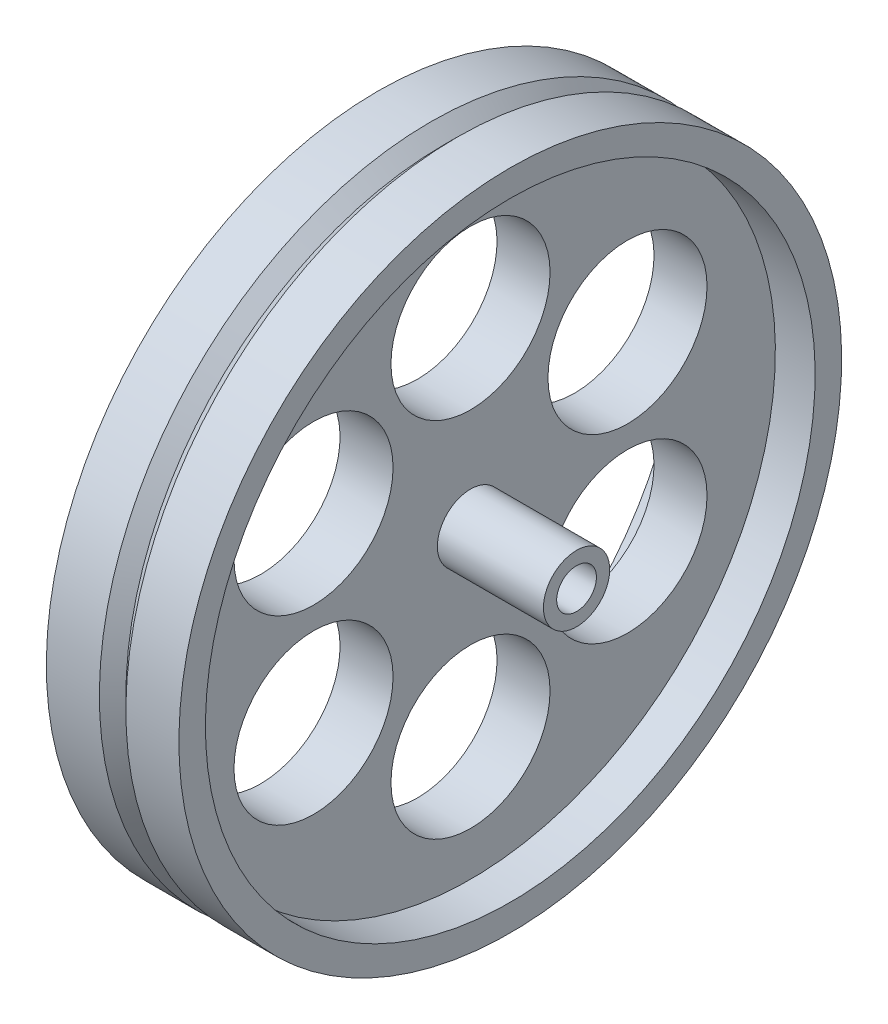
ISO-10303-21;
HEADER;
FILE_DESCRIPTION(('STEP AP214'),'2;1');
FILE_NAME('part.step','',(''),(''),'','','');
FILE_SCHEMA(('AUTOMOTIVE_DESIGN { 1 0 10303 214 1 1 1 1 }'));
ENDSEC;
DATA;
#1=APPLICATION_CONTEXT('core data for automotive mechanical design processes');
#2=APPLICATION_PROTOCOL_DEFINITION('international standard','automotive_design',2000,#1);
#3=PRODUCT_CONTEXT('',#1,'mechanical');
#4=PRODUCT('Part','Part','',(#3));
#5=PRODUCT_RELATED_PRODUCT_CATEGORY('part','',(#4));
#6=PRODUCT_DEFINITION_FORMATION('','',#4);
#7=PRODUCT_DEFINITION_CONTEXT('part definition',#1,'design');
#8=PRODUCT_DEFINITION('design','',#6,#7);
#9=PRODUCT_DEFINITION_SHAPE('','',#8);
#10=(LENGTH_UNIT() NAMED_UNIT(*) SI_UNIT(.MILLI.,.METRE.));
#11=(NAMED_UNIT(*) PLANE_ANGLE_UNIT() SI_UNIT($,.RADIAN.));
#12=(NAMED_UNIT(*) SI_UNIT($,.STERADIAN.) SOLID_ANGLE_UNIT());
#13=UNCERTAINTY_MEASURE_WITH_UNIT(LENGTH_MEASURE(1.E-05),#10,'distance_accuracy_value','');
#14=(GEOMETRIC_REPRESENTATION_CONTEXT(3) GLOBAL_UNCERTAINTY_ASSIGNED_CONTEXT((#13)) GLOBAL_UNIT_ASSIGNED_CONTEXT((#10,
#11,#12)) REPRESENTATION_CONTEXT('',''));
#15=CARTESIAN_POINT('',(0.,0.,0.));
#16=DIRECTION('',(0.,0.,1.));
#17=DIRECTION('',(1.,0.,0.));
#18=AXIS2_PLACEMENT_3D('',#15,#16,#17);
#19=CARTESIAN_POINT('',(30.,-3.,0.));
#20=DIRECTION('',(1.,0.,0.));
#21=DIRECTION('',(0.,1.,0.));
#22=AXIS2_PLACEMENT_3D('',#19,#20,#21);
#23=CYLINDRICAL_SURFACE('',#22,3.);
#24=CARTESIAN_POINT('',(30.,-3.,0.));
#25=DIRECTION('',(1.,0.,0.));
#26=DIRECTION('',(0.,1.,0.));
#27=AXIS2_PLACEMENT_3D('',#24,#25,#26);
#28=CIRCLE('',#27,3.);
#29=CARTESIAN_POINT('',(30.,0.,0.));
#30=VERTEX_POINT('',#29);
#31=EDGE_CURVE('E88',#30,#30,#28,.T.);
#32=ORIENTED_EDGE('',*,*,#31,.T.);
#33=EDGE_LOOP('',(#32));
#34=FACE_BOUND('',#33,.T.);
#35=CARTESIAN_POINT('',(0.,-3.,0.));
#36=DIRECTION('',(1.,0.,0.));
#37=DIRECTION('',(0.,1.,0.));
#38=AXIS2_PLACEMENT_3D('',#35,#36,#37);
#39=CIRCLE('',#38,3.);
#40=CARTESIAN_POINT('',(0.,0.,0.));
#41=VERTEX_POINT('',#40);
#42=EDGE_CURVE('E10',#41,#41,#39,.T.);
#43=ORIENTED_EDGE('',*,*,#42,.F.);
#44=EDGE_LOOP('',(#43));
#45=FACE_BOUND('',#44,.T.);
#46=ADVANCED_FACE('F40',(#34,#45),#23,.F.);
#47=CARTESIAN_POINT('',(0.,0.,0.));
#48=DIRECTION('',(-1.,0.,0.));
#49=DIRECTION('',(0.,-1.,0.));
#50=AXIS2_PLACEMENT_3D('',#47,#48,#49);
#51=PLANE('',#50);
#52=ORIENTED_EDGE('',*,*,#42,.T.);
#53=EDGE_LOOP('',(#52));
#54=FACE_BOUND('',#53,.T.);
#55=CARTESIAN_POINT('',(0.,-3.,0.));
#56=DIRECTION('',(1.,0.,0.));
#57=DIRECTION('',(0.,1.,0.));
#58=AXIS2_PLACEMENT_3D('',#55,#56,#57);
#59=CIRCLE('',#58,5.);
#60=CARTESIAN_POINT('',(0.,2.,0.));
#61=VERTEX_POINT('',#60);
#62=EDGE_CURVE('E47',#61,#61,#59,.T.);
#63=ORIENTED_EDGE('',*,*,#62,.F.);
#64=EDGE_LOOP('',(#63));
#65=FACE_BOUND('',#64,.T.);
#66=ADVANCED_FACE('F131',(#54,#65),#51,.T.);
#67=CARTESIAN_POINT('',(30.,-3.,0.));
#68=DIRECTION('',(1.,0.,0.));
#69=DIRECTION('',(0.,1.,0.));
#70=AXIS2_PLACEMENT_3D('',#67,#68,#69);
#71=CYLINDRICAL_SURFACE('',#70,5.);
#72=ORIENTED_EDGE('',*,*,#62,.T.);
#73=EDGE_LOOP('',(#72));
#74=FACE_BOUND('',#73,.T.);
#75=CARTESIAN_POINT('',(6.00000000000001,-3.,0.));
#76=DIRECTION('',(1.,0.,0.));
#77=DIRECTION('',(0.,1.,0.));
#78=AXIS2_PLACEMENT_3D('',#75,#76,#77);
#79=CIRCLE('',#78,5.);
#80=CARTESIAN_POINT('',(6.,2.,0.));
#81=VERTEX_POINT('',#80);
#82=EDGE_CURVE('E52',#81,#81,#79,.T.);
#83=ORIENTED_EDGE('',*,*,#82,.F.);
#84=EDGE_LOOP('',(#83));
#85=FACE_BOUND('',#84,.T.);
#86=ADVANCED_FACE('F129',(#74,#85),#71,.T.);
#87=CARTESIAN_POINT('',(6.,43.,0.));
#88=DIRECTION('',(-1.,0.,0.));
#89=DIRECTION('',(0.,-1.,0.));
#90=AXIS2_PLACEMENT_3D('',#87,#88,#89);
#91=PLANE('',#90);
#92=CARTESIAN_POINT('',(6.00000000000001,-30.3517327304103,7.07769122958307E-13));
#93=DIRECTION('',(-1.,0.,0.));
#94=DIRECTION('',(0.,-1.,0.));
#95=AXIS2_PLACEMENT_3D('',#92,#93,#94);
#96=CIRCLE('',#95,12.);
#97=CARTESIAN_POINT('',(6.00000000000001,-42.3517327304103,7.07769122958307E-13));
#98=VERTEX_POINT('',#97);
#99=EDGE_CURVE('E85',#98,#98,#96,.T.);
#100=ORIENTED_EDGE('',*,*,#99,.F.);
#101=EDGE_LOOP('',(#100));
#102=FACE_BOUND('',#101,.T.);
#103=CARTESIAN_POINT('',(6.00000000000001,-16.6758663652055,-23.6872953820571));
#104=DIRECTION('',(-1.,0.,0.));
#105=DIRECTION('',(0.,-1.,0.));
#106=AXIS2_PLACEMENT_3D('',#103,#104,#105);
#107=CIRCLE('',#106,12.);
#108=CARTESIAN_POINT('',(6.00000000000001,-28.6758663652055,-23.6872953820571));
#109=VERTEX_POINT('',#108);
#110=EDGE_CURVE('E73',#109,#109,#107,.T.);
#111=ORIENTED_EDGE('',*,*,#110,.F.);
#112=EDGE_LOOP('',(#111));
#113=FACE_BOUND('',#112,.T.);
#114=CARTESIAN_POINT('',(6.00000000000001,-16.6758663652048,23.6872953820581));
#115=DIRECTION('',(-1.,0.,0.));
#116=DIRECTION('',(0.,-1.,0.));
#117=AXIS2_PLACEMENT_3D('',#114,#115,#116);
#118=CIRCLE('',#117,12.);
#119=CARTESIAN_POINT('',(6.00000000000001,-28.6758663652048,23.6872953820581));
#120=VERTEX_POINT('',#119);
#121=EDGE_CURVE('E70',#120,#120,#118,.T.);
#122=ORIENTED_EDGE('',*,*,#121,.F.);
#123=EDGE_LOOP('',(#122));
#124=FACE_BOUND('',#123,.T.);
#125=CARTESIAN_POINT('',(6.,24.3517327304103,0.));
#126=DIRECTION('',(-1.,0.,0.));
#127=DIRECTION('',(0.,-1.,0.));
#128=AXIS2_PLACEMENT_3D('',#125,#126,#127);
#129=CIRCLE('',#128,12.);
#130=CARTESIAN_POINT('',(6.,12.3517327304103,0.));
#131=VERTEX_POINT('',#130);
#132=EDGE_CURVE('E67',#131,#131,#129,.T.);
#133=ORIENTED_EDGE('',*,*,#132,.F.);
#134=EDGE_LOOP('',(#133));
#135=FACE_BOUND('',#134,.T.);
#136=CARTESIAN_POINT('',(6.00000000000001,10.6758663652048,-23.6872953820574));
#137=DIRECTION('',(-1.,0.,0.));
#138=DIRECTION('',(0.,-1.,0.));
#139=AXIS2_PLACEMENT_3D('',#136,#137,#138);
#140=CIRCLE('',#139,12.);
#141=CARTESIAN_POINT('',(6.00000000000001,-1.32413363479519,-23.6872953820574));
#142=VERTEX_POINT('',#141);
#143=EDGE_CURVE('E63',#142,#142,#140,.T.);
#144=ORIENTED_EDGE('',*,*,#143,.F.);
#145=EDGE_LOOP('',(#144));
#146=FACE_BOUND('',#145,.T.);
#147=CARTESIAN_POINT('',(6.00000000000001,10.6758663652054,23.6872953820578));
#148=DIRECTION('',(-1.,0.,0.));
#149=DIRECTION('',(0.,-1.,0.));
#150=AXIS2_PLACEMENT_3D('',#147,#148,#149);
#151=CIRCLE('',#150,12.);
#152=CARTESIAN_POINT('',(6.00000000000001,-1.32413363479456,23.6872953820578));
#153=VERTEX_POINT('',#152);
#154=EDGE_CURVE('E59',#153,#153,#151,.T.);
#155=ORIENTED_EDGE('',*,*,#154,.F.);
#156=EDGE_LOOP('',(#155));
#157=FACE_BOUND('',#156,.T.);
#158=ORIENTED_EDGE('',*,*,#82,.T.);
#159=EDGE_LOOP('',(#158));
#160=FACE_BOUND('',#159,.T.);
#161=CARTESIAN_POINT('',(6.00000000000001,-3.,0.));
#162=DIRECTION('',(1.,0.,0.));
#163=DIRECTION('',(0.,1.,0.));
#164=AXIS2_PLACEMENT_3D('',#161,#162,#163);
#165=CIRCLE('',#164,46.);
#166=CARTESIAN_POINT('',(6.,43.,0.));
#167=VERTEX_POINT('',#166);
#168=EDGE_CURVE('E121',#167,#167,#165,.T.);
#169=ORIENTED_EDGE('',*,*,#168,.F.);
#170=EDGE_LOOP('',(#169));
#171=FACE_BOUND('',#170,.T.);
#172=ADVANCED_FACE('F126',(#102,#113,#124,#135,#146,#157,#160,#171),#91,.T.);
#173=CARTESIAN_POINT('',(30.,-3.,0.));
#174=DIRECTION('',(1.,0.,0.));
#175=DIRECTION('',(0.,1.,0.));
#176=AXIS2_PLACEMENT_3D('',#173,#174,#175);
#177=CYLINDRICAL_SURFACE('',#176,46.);
#178=ORIENTED_EDGE('',*,*,#168,.T.);
#179=EDGE_LOOP('',(#178));
#180=FACE_BOUND('',#179,.T.);
#181=CARTESIAN_POINT('',(0.,-3.,0.));
#182=DIRECTION('',(1.,0.,0.));
#183=DIRECTION('',(0.,1.,0.));
#184=AXIS2_PLACEMENT_3D('',#181,#182,#183);
#185=CIRCLE('',#184,46.);
#186=CARTESIAN_POINT('',(0.,43.,0.));
#187=VERTEX_POINT('',#186);
#188=EDGE_CURVE('E118',#187,#187,#185,.T.);
#189=ORIENTED_EDGE('',*,*,#188,.F.);
#190=EDGE_LOOP('',(#189));
#191=FACE_BOUND('',#190,.T.);
#192=ADVANCED_FACE('F138',(#180,#191),#177,.F.);
#193=CARTESIAN_POINT('',(0.,47.,0.));
#194=DIRECTION('',(-1.,0.,0.));
#195=DIRECTION('',(0.,-1.,0.));
#196=AXIS2_PLACEMENT_3D('',#193,#194,#195);
#197=PLANE('',#196);
#198=ORIENTED_EDGE('',*,*,#188,.T.);
#199=EDGE_LOOP('',(#198));
#200=FACE_BOUND('',#199,.T.);
#201=CARTESIAN_POINT('',(0.,-3.,0.));
#202=DIRECTION('',(1.,0.,0.));
#203=DIRECTION('',(0.,1.,0.));
#204=AXIS2_PLACEMENT_3D('',#201,#202,#203);
#205=CIRCLE('',#204,50.);
#206=CARTESIAN_POINT('',(0.,47.,0.));
#207=VERTEX_POINT('',#206);
#208=EDGE_CURVE('E115',#207,#207,#205,.T.);
#209=ORIENTED_EDGE('',*,*,#208,.F.);
#210=EDGE_LOOP('',(#209));
#211=FACE_BOUND('',#210,.T.);
#212=ADVANCED_FACE('F192',(#200,#211),#197,.T.);
#213=CARTESIAN_POINT('',(30.,-3.,0.));
#214=DIRECTION('',(1.,0.,0.));
#215=DIRECTION('',(0.,1.,0.));
#216=AXIS2_PLACEMENT_3D('',#213,#214,#215);
#217=CYLINDRICAL_SURFACE('',#216,50.);
#218=ORIENTED_EDGE('',*,*,#208,.T.);
#219=EDGE_LOOP('',(#218));
#220=FACE_BOUND('',#219,.T.);
#221=CARTESIAN_POINT('',(8.,-3.,0.));
#222=DIRECTION('',(1.,0.,0.));
#223=DIRECTION('',(0.,1.,0.));
#224=AXIS2_PLACEMENT_3D('',#221,#222,#223);
#225=CIRCLE('',#224,50.);
#226=CARTESIAN_POINT('',(7.99999999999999,47.,0.));
#227=VERTEX_POINT('',#226);
#228=EDGE_CURVE('E112',#227,#227,#225,.T.);
#229=ORIENTED_EDGE('',*,*,#228,.F.);
#230=EDGE_LOOP('',(#229));
#231=FACE_BOUND('',#230,.T.);
#232=ADVANCED_FACE('F188',(#220,#231),#217,.T.);
#233=CARTESIAN_POINT('',(10.,-3.,0.));
#234=DIRECTION('',(-1.,0.,0.));
#235=DIRECTION('',(0.,-1.,0.));
#236=AXIS2_PLACEMENT_3D('',#233,#234,#235);
#237=CONICAL_SURFACE('',#236,48.,0.785398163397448);
#238=ORIENTED_EDGE('',*,*,#228,.T.);
#239=EDGE_LOOP('',(#238));
#240=FACE_BOUND('',#239,.T.);
#241=CARTESIAN_POINT('',(10.,-3.,0.));
#242=DIRECTION('',(1.,0.,0.));
#243=DIRECTION('',(0.,1.,0.));
#244=AXIS2_PLACEMENT_3D('',#241,#242,#243);
#245=CIRCLE('',#244,48.);
#246=CARTESIAN_POINT('',(10.,45.,0.));
#247=VERTEX_POINT('',#246);
#248=EDGE_CURVE('E109',#247,#247,#245,.T.);
#249=ORIENTED_EDGE('',*,*,#248,.F.);
#250=EDGE_LOOP('',(#249));
#251=FACE_BOUND('',#250,.T.);
#252=ADVANCED_FACE('F184',(#240,#251),#237,.T.);
#253=CARTESIAN_POINT('',(12.,-3.,0.));
#254=DIRECTION('',(1.,0.,0.));
#255=DIRECTION('',(0.,1.,0.));
#256=AXIS2_PLACEMENT_3D('',#253,#254,#255);
#257=CONICAL_SURFACE('',#256,50.,0.785398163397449);
#258=ORIENTED_EDGE('',*,*,#248,.T.);
#259=EDGE_LOOP('',(#258));
#260=FACE_BOUND('',#259,.T.);
#261=CARTESIAN_POINT('',(12.,-3.,0.));
#262=DIRECTION('',(1.,0.,0.));
#263=DIRECTION('',(0.,1.,0.));
#264=AXIS2_PLACEMENT_3D('',#261,#262,#263);
#265=CIRCLE('',#264,50.);
#266=CARTESIAN_POINT('',(12.,47.,0.));
#267=VERTEX_POINT('',#266);
#268=EDGE_CURVE('E106',#267,#267,#265,.T.);
#269=ORIENTED_EDGE('',*,*,#268,.F.);
#270=EDGE_LOOP('',(#269));
#271=FACE_BOUND('',#270,.T.);
#272=ADVANCED_FACE('F180',(#260,#271),#257,.T.);
#273=CARTESIAN_POINT('',(30.,-3.,0.));
#274=DIRECTION('',(1.,0.,0.));
#275=DIRECTION('',(0.,1.,0.));
#276=AXIS2_PLACEMENT_3D('',#273,#274,#275);
#277=CYLINDRICAL_SURFACE('',#276,50.);
#278=ORIENTED_EDGE('',*,*,#268,.T.);
#279=EDGE_LOOP('',(#278));
#280=FACE_BOUND('',#279,.T.);
#281=CARTESIAN_POINT('',(20.,-3.,0.));
#282=DIRECTION('',(1.,0.,0.));
#283=DIRECTION('',(0.,1.,0.));
#284=AXIS2_PLACEMENT_3D('',#281,#282,#283);
#285=CIRCLE('',#284,50.);
#286=CARTESIAN_POINT('',(20.,47.,0.));
#287=VERTEX_POINT('',#286);
#288=EDGE_CURVE('E103',#287,#287,#285,.T.);
#289=ORIENTED_EDGE('',*,*,#288,.F.);
#290=EDGE_LOOP('',(#289));
#291=FACE_BOUND('',#290,.T.);
#292=ADVANCED_FACE('F176',(#280,#291),#277,.T.);
#293=CARTESIAN_POINT('',(20.,47.,0.));
#294=DIRECTION('',(1.,0.,0.));
#295=DIRECTION('',(0.,1.,0.));
#296=AXIS2_PLACEMENT_3D('',#293,#294,#295);
#297=PLANE('',#296);
#298=ORIENTED_EDGE('',*,*,#288,.T.);
#299=EDGE_LOOP('',(#298));
#300=FACE_BOUND('',#299,.T.);
#301=CARTESIAN_POINT('',(20.,-3.,0.));
#302=DIRECTION('',(1.,0.,0.));
#303=DIRECTION('',(0.,1.,0.));
#304=AXIS2_PLACEMENT_3D('',#301,#302,#303);
#305=CIRCLE('',#304,46.);
#306=CARTESIAN_POINT('',(20.,43.,0.));
#307=VERTEX_POINT('',#306);
#308=EDGE_CURVE('E100',#307,#307,#305,.T.);
#309=ORIENTED_EDGE('',*,*,#308,.F.);
#310=EDGE_LOOP('',(#309));
#311=FACE_BOUND('',#310,.T.);
#312=ADVANCED_FACE('F172',(#300,#311),#297,.T.);
#313=CARTESIAN_POINT('',(30.,-3.,0.));
#314=DIRECTION('',(1.,0.,0.));
#315=DIRECTION('',(0.,1.,0.));
#316=AXIS2_PLACEMENT_3D('',#313,#314,#315);
#317=CYLINDRICAL_SURFACE('',#316,46.);
#318=ORIENTED_EDGE('',*,*,#308,.T.);
#319=EDGE_LOOP('',(#318));
#320=FACE_BOUND('',#319,.T.);
#321=CARTESIAN_POINT('',(14.,-3.,0.));
#322=DIRECTION('',(1.,0.,0.));
#323=DIRECTION('',(0.,1.,0.));
#324=AXIS2_PLACEMENT_3D('',#321,#322,#323);
#325=CIRCLE('',#324,46.);
#326=CARTESIAN_POINT('',(14.,43.,0.));
#327=VERTEX_POINT('',#326);
#328=EDGE_CURVE('E97',#327,#327,#325,.T.);
#329=ORIENTED_EDGE('',*,*,#328,.F.);
#330=EDGE_LOOP('',(#329));
#331=FACE_BOUND('',#330,.T.);
#332=ADVANCED_FACE('F168',(#320,#331),#317,.F.);
#333=CARTESIAN_POINT('',(14.,43.,0.));
#334=DIRECTION('',(1.,0.,0.));
#335=DIRECTION('',(0.,1.,0.));
#336=AXIS2_PLACEMENT_3D('',#333,#334,#335);
#337=PLANE('',#336);
#338=CARTESIAN_POINT('',(14.,-30.3517327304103,7.07769122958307E-13));
#339=DIRECTION('',(1.,0.,0.));
#340=DIRECTION('',(0.,1.,0.));
#341=AXIS2_PLACEMENT_3D('',#338,#339,#340);
#342=CIRCLE('',#341,12.);
#343=CARTESIAN_POINT('',(14.,-18.3517327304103,7.07769122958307E-13));
#344=VERTEX_POINT('',#343);
#345=EDGE_CURVE('E43',#344,#344,#342,.T.);
#346=ORIENTED_EDGE('',*,*,#345,.F.);
#347=EDGE_LOOP('',(#346));
#348=FACE_BOUND('',#347,.T.);
#349=CARTESIAN_POINT('',(14.,-16.6758663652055,-23.6872953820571));
#350=DIRECTION('',(1.,0.,0.));
#351=DIRECTION('',(0.,1.,0.));
#352=AXIS2_PLACEMENT_3D('',#349,#350,#351);
#353=CIRCLE('',#352,12.);
#354=CARTESIAN_POINT('',(14.,-4.67586636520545,-23.6872953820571));
#355=VERTEX_POINT('',#354);
#356=EDGE_CURVE('E71',#355,#355,#353,.T.);
#357=ORIENTED_EDGE('',*,*,#356,.F.);
#358=EDGE_LOOP('',(#357));
#359=FACE_BOUND('',#358,.T.);
#360=CARTESIAN_POINT('',(14.,-16.6758663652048,23.6872953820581));
#361=DIRECTION('',(1.,0.,0.));
#362=DIRECTION('',(0.,1.,0.));
#363=AXIS2_PLACEMENT_3D('',#360,#361,#362);
#364=CIRCLE('',#363,12.);
#365=CARTESIAN_POINT('',(14.,-4.67586636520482,23.6872953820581));
#366=VERTEX_POINT('',#365);
#367=EDGE_CURVE('E68',#366,#366,#364,.T.);
#368=ORIENTED_EDGE('',*,*,#367,.F.);
#369=EDGE_LOOP('',(#368));
#370=FACE_BOUND('',#369,.T.);
#371=CARTESIAN_POINT('',(14.,24.3517327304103,0.));
#372=DIRECTION('',(1.,0.,0.));
#373=DIRECTION('',(0.,1.,0.));
#374=AXIS2_PLACEMENT_3D('',#371,#372,#373);
#375=CIRCLE('',#374,12.);
#376=CARTESIAN_POINT('',(14.,36.3517327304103,0.));
#377=VERTEX_POINT('',#376);
#378=EDGE_CURVE('E64',#377,#377,#375,.T.);
#379=ORIENTED_EDGE('',*,*,#378,.F.);
#380=EDGE_LOOP('',(#379));
#381=FACE_BOUND('',#380,.T.);
#382=CARTESIAN_POINT('',(14.,10.6758663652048,-23.6872953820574));
#383=DIRECTION('',(1.,0.,0.));
#384=DIRECTION('',(0.,1.,0.));
#385=AXIS2_PLACEMENT_3D('',#382,#383,#384);
#386=CIRCLE('',#385,12.);
#387=CARTESIAN_POINT('',(14.,22.6758663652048,-23.6872953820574));
#388=VERTEX_POINT('',#387);
#389=EDGE_CURVE('E60',#388,#388,#386,.T.);
#390=ORIENTED_EDGE('',*,*,#389,.F.);
#391=EDGE_LOOP('',(#390));
#392=FACE_BOUND('',#391,.T.);
#393=CARTESIAN_POINT('',(14.,10.6758663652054,23.6872953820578));
#394=DIRECTION('',(1.,0.,0.));
#395=DIRECTION('',(0.,1.,0.));
#396=AXIS2_PLACEMENT_3D('',#393,#394,#395);
#397=CIRCLE('',#396,12.);
#398=CARTESIAN_POINT('',(14.,22.6758663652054,23.6872953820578));
#399=VERTEX_POINT('',#398);
#400=EDGE_CURVE('E56',#399,#399,#397,.T.);
#401=ORIENTED_EDGE('',*,*,#400,.F.);
#402=EDGE_LOOP('',(#401));
#403=FACE_BOUND('',#402,.T.);
#404=ORIENTED_EDGE('',*,*,#328,.T.);
#405=EDGE_LOOP('',(#404));
#406=FACE_BOUND('',#405,.T.);
#407=CARTESIAN_POINT('',(14.,-3.,0.));
#408=DIRECTION('',(1.,0.,0.));
#409=DIRECTION('',(0.,1.,0.));
#410=AXIS2_PLACEMENT_3D('',#407,#408,#409);
#411=CIRCLE('',#410,5.);
#412=CARTESIAN_POINT('',(14.,2.,0.));
#413=VERTEX_POINT('',#412);
#414=EDGE_CURVE('E94',#413,#413,#411,.T.);
#415=ORIENTED_EDGE('',*,*,#414,.F.);
#416=EDGE_LOOP('',(#415));
#417=FACE_BOUND('',#416,.T.);
#418=ADVANCED_FACE('F161',(#348,#359,#370,#381,#392,#403,#406,#417),#337,.T.);
#419=CARTESIAN_POINT('',(30.,-3.,0.));
#420=DIRECTION('',(1.,0.,0.));
#421=DIRECTION('',(0.,1.,0.));
#422=AXIS2_PLACEMENT_3D('',#419,#420,#421);
#423=CYLINDRICAL_SURFACE('',#422,5.);
#424=ORIENTED_EDGE('',*,*,#414,.T.);
#425=EDGE_LOOP('',(#424));
#426=FACE_BOUND('',#425,.T.);
#427=CARTESIAN_POINT('',(30.,-3.,0.));
#428=DIRECTION('',(1.,0.,0.));
#429=DIRECTION('',(0.,1.,0.));
#430=AXIS2_PLACEMENT_3D('',#427,#428,#429);
#431=CIRCLE('',#430,5.);
#432=CARTESIAN_POINT('',(30.,2.,0.));
#433=VERTEX_POINT('',#432);
#434=EDGE_CURVE('E91',#433,#433,#431,.T.);
#435=ORIENTED_EDGE('',*,*,#434,.F.);
#436=EDGE_LOOP('',(#435));
#437=FACE_BOUND('',#436,.T.);
#438=ADVANCED_FACE('F151',(#426,#437),#423,.T.);
#439=CARTESIAN_POINT('',(30.,2.,0.));
#440=DIRECTION('',(1.,0.,0.));
#441=DIRECTION('',(0.,1.,0.));
#442=AXIS2_PLACEMENT_3D('',#439,#440,#441);
#443=PLANE('',#442);
#444=ORIENTED_EDGE('',*,*,#434,.T.);
#445=EDGE_LOOP('',(#444));
#446=FACE_BOUND('',#445,.T.);
#447=ORIENTED_EDGE('',*,*,#31,.F.);
#448=EDGE_LOOP('',(#447));
#449=FACE_BOUND('',#448,.T.);
#450=ADVANCED_FACE('F148',(#446,#449),#443,.T.);
#451=CARTESIAN_POINT('',(53.9411254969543,10.6758663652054,23.6872953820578));
#452=DIRECTION('',(-1.,0.,0.));
#453=DIRECTION('',(0.,-1.,0.));
#454=AXIS2_PLACEMENT_3D('',#451,#452,#453);
#455=CYLINDRICAL_SURFACE('',#454,12.);
#456=ORIENTED_EDGE('',*,*,#154,.T.);
#457=EDGE_LOOP('',(#456));
#458=FACE_BOUND('',#457,.T.);
#459=ORIENTED_EDGE('',*,*,#400,.T.);
#460=EDGE_LOOP('',(#459));
#461=FACE_BOUND('',#460,.T.);
#462=ADVANCED_FACE('F150',(#458,#461),#455,.F.);
#463=CARTESIAN_POINT('',(53.9411254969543,10.6758663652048,-23.6872953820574));
#464=DIRECTION('',(-1.,0.,0.));
#465=DIRECTION('',(0.,-1.,0.));
#466=AXIS2_PLACEMENT_3D('',#463,#464,#465);
#467=CYLINDRICAL_SURFACE('',#466,12.);
#468=ORIENTED_EDGE('',*,*,#143,.T.);
#469=EDGE_LOOP('',(#468));
#470=FACE_BOUND('',#469,.T.);
#471=ORIENTED_EDGE('',*,*,#389,.T.);
#472=EDGE_LOOP('',(#471));
#473=FACE_BOUND('',#472,.T.);
#474=ADVANCED_FACE('F158',(#470,#473),#467,.F.);
#475=CARTESIAN_POINT('',(53.9411254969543,24.3517327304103,0.));
#476=DIRECTION('',(-1.,0.,0.));
#477=DIRECTION('',(0.,-1.,0.));
#478=AXIS2_PLACEMENT_3D('',#475,#476,#477);
#479=CYLINDRICAL_SURFACE('',#478,12.);
#480=ORIENTED_EDGE('',*,*,#132,.T.);
#481=EDGE_LOOP('',(#480));
#482=FACE_BOUND('',#481,.T.);
#483=ORIENTED_EDGE('',*,*,#378,.T.);
#484=EDGE_LOOP('',(#483));
#485=FACE_BOUND('',#484,.T.);
#486=ADVANCED_FACE('F281',(#482,#485),#479,.F.);
#487=CARTESIAN_POINT('',(53.9411254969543,-16.6758663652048,23.6872953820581));
#488=DIRECTION('',(-1.,0.,0.));
#489=DIRECTION('',(0.,-1.,0.));
#490=AXIS2_PLACEMENT_3D('',#487,#488,#489);
#491=CYLINDRICAL_SURFACE('',#490,12.);
#492=ORIENTED_EDGE('',*,*,#121,.T.);
#493=EDGE_LOOP('',(#492));
#494=FACE_BOUND('',#493,.T.);
#495=ORIENTED_EDGE('',*,*,#367,.T.);
#496=EDGE_LOOP('',(#495));
#497=FACE_BOUND('',#496,.T.);
#498=ADVANCED_FACE('F291',(#494,#497),#491,.F.);
#499=CARTESIAN_POINT('',(53.9411254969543,-16.6758663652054,-23.6872953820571));
#500=DIRECTION('',(-1.,0.,0.));
#501=DIRECTION('',(0.,-1.,0.));
#502=AXIS2_PLACEMENT_3D('',#499,#500,#501);
#503=CYLINDRICAL_SURFACE('',#502,12.);
#504=ORIENTED_EDGE('',*,*,#110,.T.);
#505=EDGE_LOOP('',(#504));
#506=FACE_BOUND('',#505,.T.);
#507=ORIENTED_EDGE('',*,*,#356,.T.);
#508=EDGE_LOOP('',(#507));
#509=FACE_BOUND('',#508,.T.);
#510=ADVANCED_FACE('F301',(#506,#509),#503,.F.);
#511=CARTESIAN_POINT('',(53.9411254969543,-30.3517327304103,7.07769122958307E-13));
#512=DIRECTION('',(-1.,0.,0.));
#513=DIRECTION('',(0.,-1.,0.));
#514=AXIS2_PLACEMENT_3D('',#511,#512,#513);
#515=CYLINDRICAL_SURFACE('',#514,12.);
#516=ORIENTED_EDGE('',*,*,#99,.T.);
#517=EDGE_LOOP('',(#516));
#518=FACE_BOUND('',#517,.T.);
#519=ORIENTED_EDGE('',*,*,#345,.T.);
#520=EDGE_LOOP('',(#519));
#521=FACE_BOUND('',#520,.T.);
#522=ADVANCED_FACE('F309',(#518,#521),#515,.F.);
#523=CLOSED_SHELL('',(#46,#66,#86,#172,#192,#212,#232,#252,#272,#292,#312,#332,#418,#438,#450,
#462,#474,#486,#498,#510,#522));
#524=MANIFOLD_SOLID_BREP('B2',#523);
#525=ADVANCED_BREP_SHAPE_REPRESENTATION('',(#18,#524),#14);
#526=SHAPE_DEFINITION_REPRESENTATION(#9,#525);
ENDSEC;
END-ISO-10303-21;
